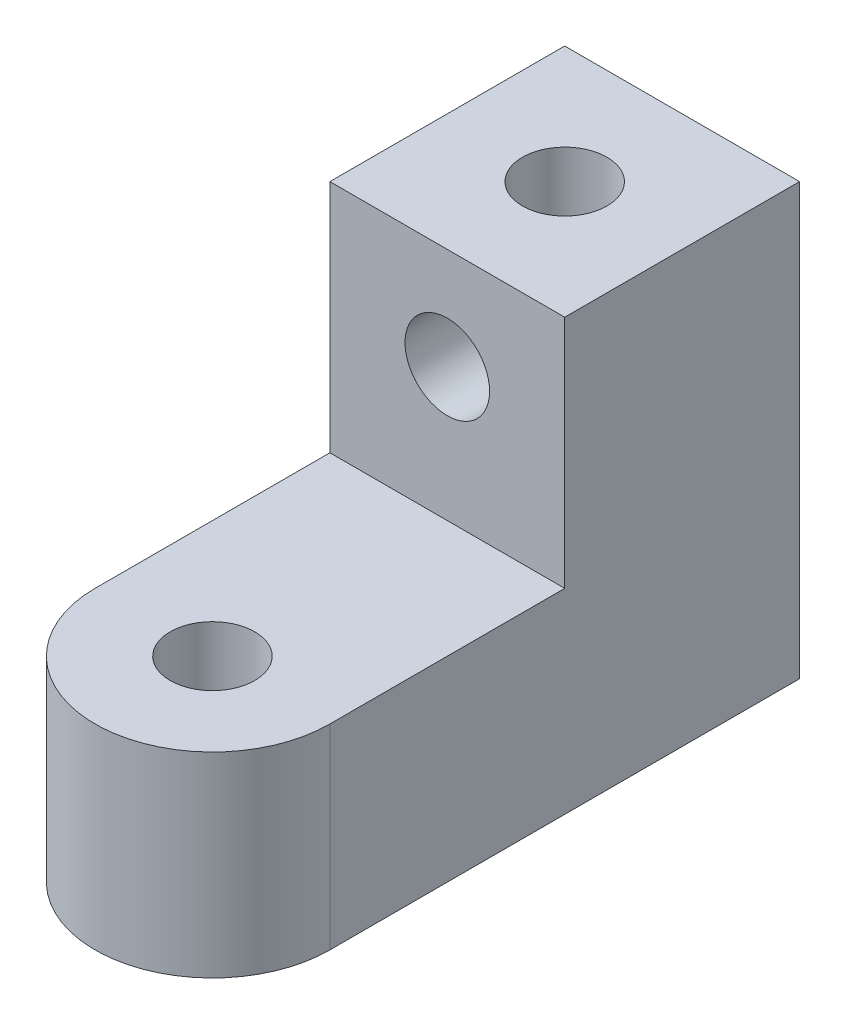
ISO-10303-21;
HEADER;
FILE_DESCRIPTION(('STEP AP214'),'2;1');
FILE_NAME('part.step','',(''),(''),'','','');
FILE_SCHEMA(('AUTOMOTIVE_DESIGN { 1 0 10303 214 1 1 1 1 }'));
ENDSEC;
DATA;
#1=APPLICATION_CONTEXT('core data for automotive mechanical design processes');
#2=APPLICATION_PROTOCOL_DEFINITION('international standard','automotive_design',2000,#1);
#3=PRODUCT_CONTEXT('',#1,'mechanical');
#4=PRODUCT('Part','Part','',(#3));
#5=PRODUCT_RELATED_PRODUCT_CATEGORY('part','',(#4));
#6=PRODUCT_DEFINITION_FORMATION('','',#4);
#7=PRODUCT_DEFINITION_CONTEXT('part definition',#1,'design');
#8=PRODUCT_DEFINITION('design','',#6,#7);
#9=PRODUCT_DEFINITION_SHAPE('','',#8);
#10=(LENGTH_UNIT() NAMED_UNIT(*) SI_UNIT(.MILLI.,.METRE.));
#11=(NAMED_UNIT(*) PLANE_ANGLE_UNIT() SI_UNIT($,.RADIAN.));
#12=(NAMED_UNIT(*) SI_UNIT($,.STERADIAN.) SOLID_ANGLE_UNIT());
#13=UNCERTAINTY_MEASURE_WITH_UNIT(LENGTH_MEASURE(1.E-05),#10,'distance_accuracy_value','');
#14=(GEOMETRIC_REPRESENTATION_CONTEXT(3) GLOBAL_UNCERTAINTY_ASSIGNED_CONTEXT((#13)) GLOBAL_UNIT_ASSIGNED_CONTEXT((#10,
#11,#12)) REPRESENTATION_CONTEXT('',''));
#15=CARTESIAN_POINT('',(0.,0.,0.));
#16=DIRECTION('',(0.,0.,1.));
#17=DIRECTION('',(1.,0.,0.));
#18=AXIS2_PLACEMENT_3D('',#15,#16,#17);
#19=CARTESIAN_POINT('',(0.,0.,60.));
#20=DIRECTION('',(0.,-1.,0.));
#21=DIRECTION('',(0.,0.,-1.));
#22=AXIS2_PLACEMENT_3D('',#19,#20,#21);
#23=PLANE('',#22);
#24=CARTESIAN_POINT('',(0.,0.,15.));
#25=DIRECTION('',(0.,1.,0.));
#26=DIRECTION('',(0.,0.,1.));
#27=AXIS2_PLACEMENT_3D('',#24,#25,#26);
#28=CIRCLE('',#27,5.39999999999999);
#29=CARTESIAN_POINT('',(0.,0.,20.4));
#30=VERTEX_POINT('',#29);
#31=EDGE_CURVE('E305',#30,#30,#28,.T.);
#32=ORIENTED_EDGE('',*,*,#31,.T.);
#33=EDGE_LOOP('',(#32));
#34=FACE_BOUND('',#33,.T.);
#35=DIRECTION('',(0.,0.,1.));
#36=VECTOR('',#35,1.);
#37=CARTESIAN_POINT('',(-15.,0.,60.));
#38=LINE('',#37,#36);
#39=CARTESIAN_POINT('',(-15.,0.,0.));
#40=VERTEX_POINT('',#39);
#41=CARTESIAN_POINT('',(-15.,0.,60.));
#42=VERTEX_POINT('',#41);
#43=EDGE_CURVE('E110',#40,#42,#38,.T.);
#44=ORIENTED_EDGE('',*,*,#43,.F.);
#45=DIRECTION('',(-1.,0.,0.));
#46=VECTOR('',#45,1.);
#47=CARTESIAN_POINT('',(-15.,0.,0.));
#48=LINE('',#47,#46);
#49=CARTESIAN_POINT('',(15.,0.,0.));
#50=VERTEX_POINT('',#49);
#51=EDGE_CURVE('E143',#50,#40,#48,.T.);
#52=ORIENTED_EDGE('',*,*,#51,.F.);
#53=DIRECTION('',(0.,0.,-1.));
#54=VECTOR('',#53,1.);
#55=CARTESIAN_POINT('',(15.,0.,0.));
#56=LINE('',#55,#54);
#57=CARTESIAN_POINT('',(15.,0.,60.));
#58=VERTEX_POINT('',#57);
#59=EDGE_CURVE('E141',#58,#50,#56,.T.);
#60=ORIENTED_EDGE('',*,*,#59,.F.);
#61=CARTESIAN_POINT('',(0.,0.,60.));
#62=DIRECTION('',(0.,1.,0.));
#63=DIRECTION('',(0.,0.,-1.));
#64=AXIS2_PLACEMENT_3D('',#61,#62,#63);
#65=CIRCLE('',#64,15.);
#66=EDGE_CURVE('E139',#42,#58,#65,.T.);
#67=ORIENTED_EDGE('',*,*,#66,.F.);
#68=EDGE_LOOP('',(#44,#52,#60,#67));
#69=FACE_BOUND('',#68,.T.);
#70=CARTESIAN_POINT('',(0.,0.,60.));
#71=DIRECTION('',(0.,1.,0.));
#72=DIRECTION('',(0.,0.,1.));
#73=AXIS2_PLACEMENT_3D('',#70,#71,#72);
#74=CIRCLE('',#73,5.39999999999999);
#75=CARTESIAN_POINT('',(0.,0.,65.4));
#76=VERTEX_POINT('',#75);
#77=EDGE_CURVE('E293',#76,#76,#74,.T.);
#78=ORIENTED_EDGE('',*,*,#77,.T.);
#79=EDGE_LOOP('',(#78));
#80=FACE_BOUND('',#79,.T.);
#81=ADVANCED_FACE('F33',(#34,#69,#80),#23,.T.);
#82=CARTESIAN_POINT('',(0.,55.,15.));
#83=DIRECTION('',(0.,1.,0.));
#84=DIRECTION('',(0.,0.,1.));
#85=AXIS2_PLACEMENT_3D('',#82,#83,#84);
#86=CYLINDRICAL_SURFACE('',#85,5.39999999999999);
#87=CARTESIAN_POINT('',(0.,55.,15.));
#88=DIRECTION('',(0.,1.,0.));
#89=DIRECTION('',(0.,0.,1.));
#90=AXIS2_PLACEMENT_3D('',#87,#88,#89);
#91=CIRCLE('',#90,5.39999999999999);
#92=CARTESIAN_POINT('',(0.,55.,20.4));
#93=VERTEX_POINT('',#92);
#94=EDGE_CURVE('E120',#93,#93,#91,.T.);
#95=ORIENTED_EDGE('',*,*,#94,.T.);
#96=EDGE_LOOP('',(#95));
#97=FACE_BOUND('',#96,.T.);
#98=CARTESIAN_POINT('',(0.,42.,15.));
#99=DIRECTION('',(0.,0.707106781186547,-0.707106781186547));
#100=DIRECTION('',(0.,0.707106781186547,0.707106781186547));
#101=AXIS2_PLACEMENT_3D('',#98,#99,#100);
#102=ELLIPSE('',#101,7.6367532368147,5.39999999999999);
#103=CARTESIAN_POINT('',(5.39999999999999,42.,15.));
#104=VERTEX_POINT('',#103);
#105=CARTESIAN_POINT('',(-5.39999999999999,42.,15.));
#106=VERTEX_POINT('',#105);
#107=EDGE_CURVE('E46',#104,#106,#102,.F.);
#108=ORIENTED_EDGE('',*,*,#107,.T.);
#109=CARTESIAN_POINT('',(0.,42.,15.));
#110=DIRECTION('',(0.,0.707106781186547,0.707106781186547));
#111=DIRECTION('',(0.,0.707106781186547,-0.707106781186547));
#112=AXIS2_PLACEMENT_3D('',#109,#110,#111);
#113=ELLIPSE('',#112,7.6367532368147,5.39999999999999);
#114=EDGE_CURVE('E11',#106,#104,#113,.F.);
#115=ORIENTED_EDGE('',*,*,#114,.T.);
#116=EDGE_LOOP('',(#108,#115));
#117=FACE_BOUND('',#116,.T.);
#118=ADVANCED_FACE('F101',(#97,#117),#86,.F.);
#119=CARTESIAN_POINT('',(0.,25.,60.));
#120=DIRECTION('',(0.,-1.,0.));
#121=DIRECTION('',(0.,0.,-1.));
#122=AXIS2_PLACEMENT_3D('',#119,#120,#121);
#123=PLANE('',#122);
#124=CARTESIAN_POINT('',(0.,25.,60.));
#125=DIRECTION('',(0.,1.,0.));
#126=DIRECTION('',(0.,0.,1.));
#127=AXIS2_PLACEMENT_3D('',#124,#125,#126);
#128=CIRCLE('',#127,5.39999999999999);
#129=CARTESIAN_POINT('',(0.,25.,65.4));
#130=VERTEX_POINT('',#129);
#131=EDGE_CURVE('E296',#130,#130,#128,.T.);
#132=ORIENTED_EDGE('',*,*,#131,.F.);
#133=EDGE_LOOP('',(#132));
#134=FACE_BOUND('',#133,.T.);
#135=DIRECTION('',(1.,0.,0.));
#136=VECTOR('',#135,1.);
#137=CARTESIAN_POINT('',(-15.,25.,30.));
#138=LINE('',#137,#136);
#139=CARTESIAN_POINT('',(-15.,25.,30.));
#140=VERTEX_POINT('',#139);
#141=CARTESIAN_POINT('',(15.,25.,30.));
#142=VERTEX_POINT('',#141);
#143=EDGE_CURVE('E54',#140,#142,#138,.T.);
#144=ORIENTED_EDGE('',*,*,#143,.F.);
#145=DIRECTION('',(0.,0.,1.));
#146=VECTOR('',#145,1.);
#147=CARTESIAN_POINT('',(-15.,25.,60.));
#148=LINE('',#147,#146);
#149=CARTESIAN_POINT('',(-15.,25.,60.));
#150=VERTEX_POINT('',#149);
#151=EDGE_CURVE('E145',#140,#150,#148,.T.);
#152=ORIENTED_EDGE('',*,*,#151,.T.);
#153=CARTESIAN_POINT('',(0.,25.,60.));
#154=DIRECTION('',(0.,1.,0.));
#155=DIRECTION('',(0.,0.,-1.));
#156=AXIS2_PLACEMENT_3D('',#153,#154,#155);
#157=CIRCLE('',#156,15.);
#158=CARTESIAN_POINT('',(15.,25.,60.));
#159=VERTEX_POINT('',#158);
#160=EDGE_CURVE('E148',#150,#159,#157,.T.);
#161=ORIENTED_EDGE('',*,*,#160,.T.);
#162=DIRECTION('',(0.,0.,-1.));
#163=VECTOR('',#162,1.);
#164=CARTESIAN_POINT('',(15.,25.,0.));
#165=LINE('',#164,#163);
#166=EDGE_CURVE('E121',#159,#142,#165,.T.);
#167=ORIENTED_EDGE('',*,*,#166,.T.);
#168=EDGE_LOOP('',(#144,#152,#161,#167));
#169=FACE_BOUND('',#168,.T.);
#170=ADVANCED_FACE('F167',(#134,#169),#123,.F.);
#171=CARTESIAN_POINT('',(-15.,25.,60.));
#172=DIRECTION('',(1.,0.,0.));
#173=DIRECTION('',(0.,0.,-1.));
#174=AXIS2_PLACEMENT_3D('',#171,#172,#173);
#175=PLANE('',#174);
#176=ORIENTED_EDGE('',*,*,#43,.T.);
#177=DIRECTION('',(0.,-1.,0.));
#178=VECTOR('',#177,1.);
#179=CARTESIAN_POINT('',(-15.,25.,60.));
#180=LINE('',#179,#178);
#181=EDGE_CURVE('E99',#150,#42,#180,.T.);
#182=ORIENTED_EDGE('',*,*,#181,.F.);
#183=ORIENTED_EDGE('',*,*,#151,.F.);
#184=DIRECTION('',(0.,-1.,0.));
#185=VECTOR('',#184,1.);
#186=CARTESIAN_POINT('',(-15.,55.,30.));
#187=LINE('',#186,#185);
#188=CARTESIAN_POINT('',(-15.,55.,30.));
#189=VERTEX_POINT('',#188);
#190=EDGE_CURVE('E107',#189,#140,#187,.T.);
#191=ORIENTED_EDGE('',*,*,#190,.F.);
#192=DIRECTION('',(0.,0.,1.));
#193=VECTOR('',#192,1.);
#194=CARTESIAN_POINT('',(-15.,55.,0.));
#195=LINE('',#194,#193);
#196=CARTESIAN_POINT('',(-15.,55.,0.));
#197=VERTEX_POINT('',#196);
#198=EDGE_CURVE('E119',#197,#189,#195,.T.);
#199=ORIENTED_EDGE('',*,*,#198,.F.);
#200=DIRECTION('',(0.,-1.,0.));
#201=VECTOR('',#200,1.);
#202=CARTESIAN_POINT('',(-15.,25.,0.));
#203=LINE('',#202,#201);
#204=EDGE_CURVE('E158',#197,#40,#203,.T.);
#205=ORIENTED_EDGE('',*,*,#204,.T.);
#206=EDGE_LOOP('',(#176,#182,#183,#191,#199,#205));
#207=FACE_BOUND('',#206,.T.);
#208=ADVANCED_FACE('F35',(#207),#175,.F.);
#209=CARTESIAN_POINT('',(0.,25.,60.));
#210=DIRECTION('',(0.,-1.,0.));
#211=DIRECTION('',(0.,0.,-1.));
#212=AXIS2_PLACEMENT_3D('',#209,#210,#211);
#213=CYLINDRICAL_SURFACE('',#212,15.);
#214=ORIENTED_EDGE('',*,*,#66,.T.);
#215=DIRECTION('',(0.,-1.,0.));
#216=VECTOR('',#215,1.);
#217=CARTESIAN_POINT('',(15.,25.,60.));
#218=LINE('',#217,#216);
#219=EDGE_CURVE('E152',#159,#58,#218,.T.);
#220=ORIENTED_EDGE('',*,*,#219,.F.);
#221=ORIENTED_EDGE('',*,*,#160,.F.);
#222=ORIENTED_EDGE('',*,*,#181,.T.);
#223=EDGE_LOOP('',(#214,#220,#221,#222));
#224=FACE_BOUND('',#223,.T.);
#225=ADVANCED_FACE('F170',(#224),#213,.T.);
#226=CARTESIAN_POINT('',(15.,25.,0.));
#227=DIRECTION('',(-1.,0.,0.));
#228=DIRECTION('',(0.,0.,1.));
#229=AXIS2_PLACEMENT_3D('',#226,#227,#228);
#230=PLANE('',#229);
#231=ORIENTED_EDGE('',*,*,#59,.T.);
#232=DIRECTION('',(0.,-1.,0.));
#233=VECTOR('',#232,1.);
#234=CARTESIAN_POINT('',(15.,25.,0.));
#235=LINE('',#234,#233);
#236=CARTESIAN_POINT('',(15.,55.,0.));
#237=VERTEX_POINT('',#236);
#238=EDGE_CURVE('E155',#237,#50,#235,.T.);
#239=ORIENTED_EDGE('',*,*,#238,.F.);
#240=DIRECTION('',(0.,0.,-1.));
#241=VECTOR('',#240,1.);
#242=CARTESIAN_POINT('',(15.,55.,0.));
#243=LINE('',#242,#241);
#244=CARTESIAN_POINT('',(15.,55.,30.));
#245=VERTEX_POINT('',#244);
#246=EDGE_CURVE('E132',#245,#237,#243,.T.);
#247=ORIENTED_EDGE('',*,*,#246,.F.);
#248=DIRECTION('',(0.,-1.,0.));
#249=VECTOR('',#248,1.);
#250=CARTESIAN_POINT('',(15.,55.,30.));
#251=LINE('',#250,#249);
#252=EDGE_CURVE('E111',#245,#142,#251,.T.);
#253=ORIENTED_EDGE('',*,*,#252,.T.);
#254=ORIENTED_EDGE('',*,*,#166,.F.);
#255=ORIENTED_EDGE('',*,*,#219,.T.);
#256=EDGE_LOOP('',(#231,#239,#247,#253,#254,#255));
#257=FACE_BOUND('',#256,.T.);
#258=ADVANCED_FACE('F173',(#257),#230,.F.);
#259=CARTESIAN_POINT('',(-15.,25.,0.));
#260=DIRECTION('',(0.,0.,1.));
#261=DIRECTION('',(1.,0.,0.));
#262=AXIS2_PLACEMENT_3D('',#259,#260,#261);
#263=PLANE('',#262);
#264=CARTESIAN_POINT('',(0.,42.,0.));
#265=DIRECTION('',(0.,0.,1.));
#266=DIRECTION('',(1.,0.,0.));
#267=AXIS2_PLACEMENT_3D('',#264,#265,#266);
#268=CIRCLE('',#267,5.39999999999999);
#269=CARTESIAN_POINT('',(5.39999999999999,42.,0.));
#270=VERTEX_POINT('',#269);
#271=EDGE_CURVE('E297',#270,#270,#268,.T.);
#272=ORIENTED_EDGE('',*,*,#271,.T.);
#273=EDGE_LOOP('',(#272));
#274=FACE_BOUND('',#273,.T.);
#275=ORIENTED_EDGE('',*,*,#51,.T.);
#276=ORIENTED_EDGE('',*,*,#204,.F.);
#277=DIRECTION('',(-1.,0.,0.));
#278=VECTOR('',#277,1.);
#279=CARTESIAN_POINT('',(-15.,55.,0.));
#280=LINE('',#279,#278);
#281=EDGE_CURVE('E116',#237,#197,#280,.T.);
#282=ORIENTED_EDGE('',*,*,#281,.F.);
#283=ORIENTED_EDGE('',*,*,#238,.T.);
#284=EDGE_LOOP('',(#275,#276,#282,#283));
#285=FACE_BOUND('',#284,.T.);
#286=ADVANCED_FACE('F184',(#274,#285),#263,.F.);
#287=CARTESIAN_POINT('',(-15.,55.,30.));
#288=DIRECTION('',(0.,0.,-1.));
#289=DIRECTION('',(-1.,0.,0.));
#290=AXIS2_PLACEMENT_3D('',#287,#288,#289);
#291=PLANE('',#290);
#292=CARTESIAN_POINT('',(0.,42.,30.));
#293=DIRECTION('',(0.,0.,1.));
#294=DIRECTION('',(1.,0.,0.));
#295=AXIS2_PLACEMENT_3D('',#292,#293,#294);
#296=CIRCLE('',#295,5.39999999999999);
#297=CARTESIAN_POINT('',(5.39999999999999,42.,30.));
#298=VERTEX_POINT('',#297);
#299=EDGE_CURVE('E300',#298,#298,#296,.T.);
#300=ORIENTED_EDGE('',*,*,#299,.F.);
#301=EDGE_LOOP('',(#300));
#302=FACE_BOUND('',#301,.T.);
#303=ORIENTED_EDGE('',*,*,#143,.T.);
#304=ORIENTED_EDGE('',*,*,#252,.F.);
#305=DIRECTION('',(1.,0.,0.));
#306=VECTOR('',#305,1.);
#307=CARTESIAN_POINT('',(-15.,55.,30.));
#308=LINE('',#307,#306);
#309=EDGE_CURVE('E130',#189,#245,#308,.T.);
#310=ORIENTED_EDGE('',*,*,#309,.F.);
#311=ORIENTED_EDGE('',*,*,#190,.T.);
#312=EDGE_LOOP('',(#303,#304,#310,#311));
#313=FACE_BOUND('',#312,.T.);
#314=ADVANCED_FACE('F177',(#302,#313),#291,.F.);
#315=CARTESIAN_POINT('',(-15.,55.,30.));
#316=DIRECTION('',(0.,1.,0.));
#317=DIRECTION('',(0.,0.,1.));
#318=AXIS2_PLACEMENT_3D('',#315,#316,#317);
#319=PLANE('',#318);
#320=ORIENTED_EDGE('',*,*,#94,.F.);
#321=EDGE_LOOP('',(#320));
#322=FACE_BOUND('',#321,.T.);
#323=ORIENTED_EDGE('',*,*,#198,.T.);
#324=ORIENTED_EDGE('',*,*,#309,.T.);
#325=ORIENTED_EDGE('',*,*,#246,.T.);
#326=ORIENTED_EDGE('',*,*,#281,.T.);
#327=EDGE_LOOP('',(#323,#324,#325,#326));
#328=FACE_BOUND('',#327,.T.);
#329=ADVANCED_FACE('F186',(#322,#328),#319,.T.);
#330=CARTESIAN_POINT('',(0.,42.,15.));
#331=DIRECTION('',(0.,0.707106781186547,-0.707106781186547));
#332=DIRECTION('',(0.,0.707106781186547,0.707106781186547));
#333=AXIS2_PLACEMENT_3D('',#330,#331,#332);
#334=ELLIPSE('',#333,7.6367532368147,5.39999999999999);
#335=EDGE_CURVE('E92',#104,#106,#334,.T.);
#336=ORIENTED_EDGE('',*,*,#335,.T.);
#337=CARTESIAN_POINT('',(0.,42.,15.));
#338=DIRECTION('',(0.,0.707106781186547,0.707106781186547));
#339=DIRECTION('',(0.,0.707106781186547,-0.707106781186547));
#340=AXIS2_PLACEMENT_3D('',#337,#338,#339);
#341=ELLIPSE('',#340,7.6367532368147,5.39999999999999);
#342=EDGE_CURVE('E41',#106,#104,#341,.T.);
#343=ORIENTED_EDGE('',*,*,#342,.T.);
#344=EDGE_LOOP('',(#336,#343));
#345=FACE_BOUND('',#344,.T.);
#346=ORIENTED_EDGE('',*,*,#31,.F.);
#347=EDGE_LOOP('',(#346));
#348=FACE_BOUND('',#347,.T.);
#349=ADVANCED_FACE('F102',(#345,#348),#86,.F.);
#350=CARTESIAN_POINT('',(0.,42.,30.));
#351=DIRECTION('',(0.,0.,1.));
#352=DIRECTION('',(1.,0.,0.));
#353=AXIS2_PLACEMENT_3D('',#350,#351,#352);
#354=CYLINDRICAL_SURFACE('',#353,5.39999999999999);
#355=ORIENTED_EDGE('',*,*,#299,.T.);
#356=EDGE_LOOP('',(#355));
#357=FACE_BOUND('',#356,.T.);
#358=ORIENTED_EDGE('',*,*,#107,.F.);
#359=ORIENTED_EDGE('',*,*,#342,.F.);
#360=EDGE_LOOP('',(#358,#359));
#361=FACE_BOUND('',#360,.T.);
#362=ADVANCED_FACE('F98',(#357,#361),#354,.F.);
#363=ORIENTED_EDGE('',*,*,#271,.F.);
#364=EDGE_LOOP('',(#363));
#365=FACE_BOUND('',#364,.T.);
#366=ORIENTED_EDGE('',*,*,#335,.F.);
#367=ORIENTED_EDGE('',*,*,#114,.F.);
#368=EDGE_LOOP('',(#366,#367));
#369=FACE_BOUND('',#368,.T.);
#370=ADVANCED_FACE('F93',(#365,#369),#354,.F.);
#371=CARTESIAN_POINT('',(0.,25.,60.));
#372=DIRECTION('',(0.,1.,0.));
#373=DIRECTION('',(0.,0.,1.));
#374=AXIS2_PLACEMENT_3D('',#371,#372,#373);
#375=CYLINDRICAL_SURFACE('',#374,5.39999999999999);
#376=ORIENTED_EDGE('',*,*,#77,.F.);
#377=EDGE_LOOP('',(#376));
#378=FACE_BOUND('',#377,.T.);
#379=ORIENTED_EDGE('',*,*,#131,.T.);
#380=EDGE_LOOP('',(#379));
#381=FACE_BOUND('',#380,.T.);
#382=ADVANCED_FACE('F277',(#378,#381),#375,.F.);
#383=CLOSED_SHELL('',(#81,#118,#170,#208,#225,#258,#286,#314,#329,#349,#362,#370,#382));
#384=MANIFOLD_SOLID_BREP('B2',#383);
#385=ADVANCED_BREP_SHAPE_REPRESENTATION('',(#18,#384),#14);
#386=SHAPE_DEFINITION_REPRESENTATION(#9,#385);
ENDSEC;
END-ISO-10303-21;
